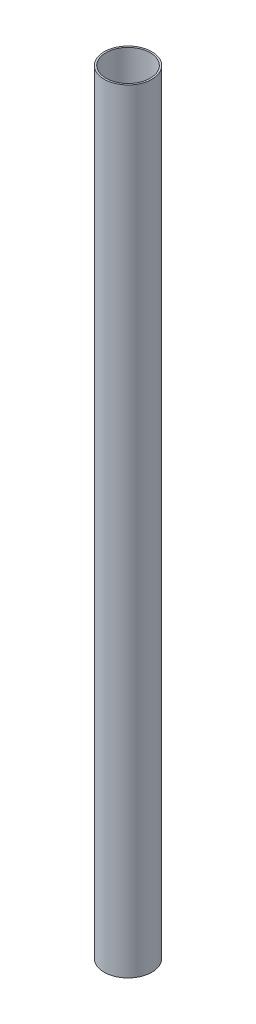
from build123d import *

# Parameters (mm, degrees)
SKETCH1_R           = 18.8087
SKETCH1_R_2         = 17.4625
BOSS_EXTRUDE1_DEPTH = 609.6


with BuildPart() as part:
    # Sketch1 → Boss-Extrude1 (new body)
    with BuildSketch(Plane(origin=(0, 0, 0), x_dir=(1, 0, 0), z_dir=(0, 1, 0))):
        with Locations(Location((0, 0, 0), (0, 0, 90))):
            Circle(SKETCH1_R)
        with Locations(Location((0, 0, 0), (0, 0, 90))):
            Circle(SKETCH1_R_2, mode=Mode.SUBTRACT)
    extrude(amount=BOSS_EXTRUDE1_DEPTH)


solid = part.part
